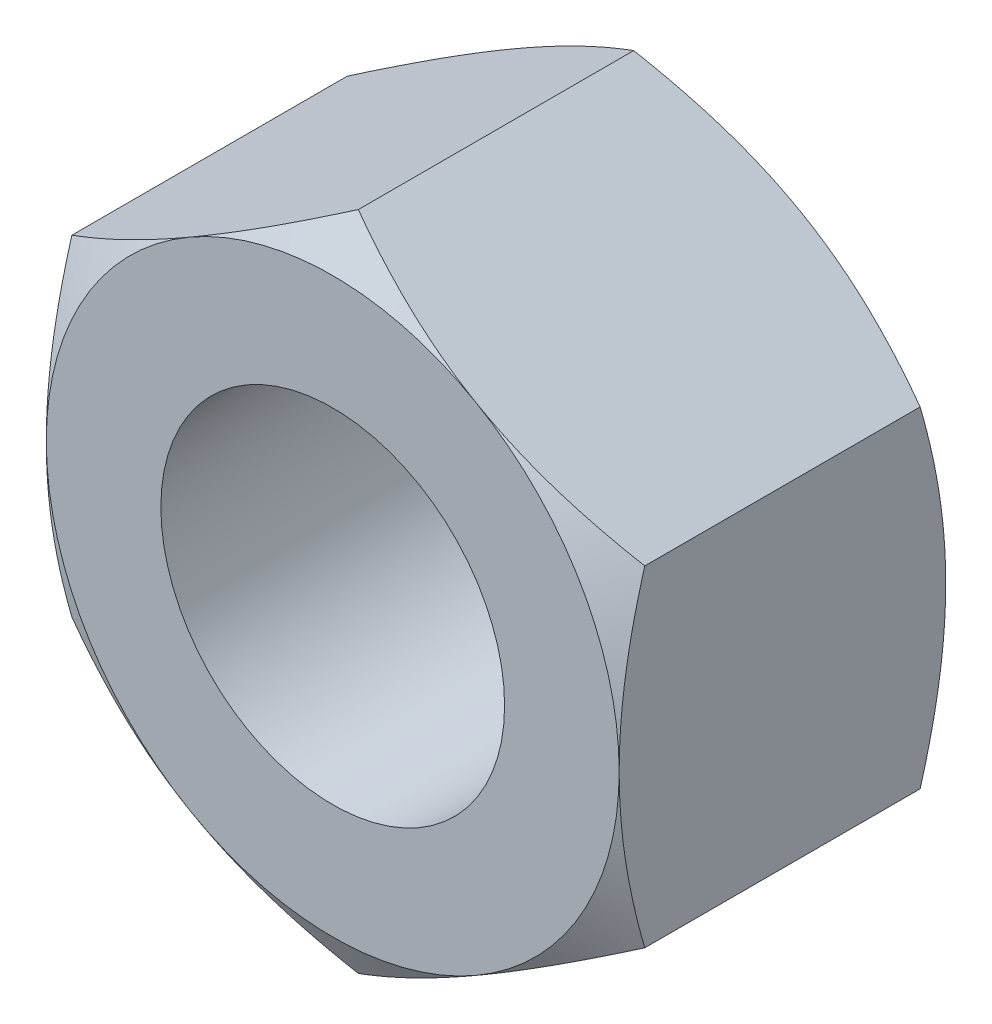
ISO-10303-21;
HEADER;
FILE_DESCRIPTION(('STEP AP214'),'2;1');
FILE_NAME('part.step','',(''),(''),'','','');
FILE_SCHEMA(('AUTOMOTIVE_DESIGN { 1 0 10303 214 1 1 1 1 }'));
ENDSEC;
DATA;
#1=APPLICATION_CONTEXT('core data for automotive mechanical design processes');
#2=APPLICATION_PROTOCOL_DEFINITION('international standard','automotive_design',2000,#1);
#3=PRODUCT_CONTEXT('',#1,'mechanical');
#4=PRODUCT('Part','Part','',(#3));
#5=PRODUCT_RELATED_PRODUCT_CATEGORY('part','',(#4));
#6=PRODUCT_DEFINITION_FORMATION('','',#4);
#7=PRODUCT_DEFINITION_CONTEXT('part definition',#1,'design');
#8=PRODUCT_DEFINITION('design','',#6,#7);
#9=PRODUCT_DEFINITION_SHAPE('','',#8);
#10=(LENGTH_UNIT() NAMED_UNIT(*) SI_UNIT(.MILLI.,.METRE.));
#11=(NAMED_UNIT(*) PLANE_ANGLE_UNIT() SI_UNIT($,.RADIAN.));
#12=(NAMED_UNIT(*) SI_UNIT($,.STERADIAN.) SOLID_ANGLE_UNIT());
#13=UNCERTAINTY_MEASURE_WITH_UNIT(LENGTH_MEASURE(1.E-05),#10,'distance_accuracy_value','');
#14=(GEOMETRIC_REPRESENTATION_CONTEXT(3) GLOBAL_UNCERTAINTY_ASSIGNED_CONTEXT((#13)) GLOBAL_UNIT_ASSIGNED_CONTEXT((#10,
#11,#12)) REPRESENTATION_CONTEXT('',''));
#15=CARTESIAN_POINT('',(0.,0.,0.));
#16=DIRECTION('',(0.,0.,1.));
#17=DIRECTION('',(1.,0.,0.));
#18=AXIS2_PLACEMENT_3D('',#15,#16,#17);
#19=CARTESIAN_POINT('',(-5.,8.66025403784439,0.));
#20=DIRECTION('',(0.,0.,-1.));
#21=DIRECTION('',(-1.,0.,0.));
#22=AXIS2_PLACEMENT_3D('',#19,#20,#21);
#23=PLANE('',#22);
#24=CARTESIAN_POINT('',(0.,0.,0.));
#25=DIRECTION('',(0.,0.,1.));
#26=DIRECTION('',(1.,0.,0.));
#27=AXIS2_PLACEMENT_3D('',#24,#25,#26);
#28=CIRCLE('',#27,3.);
#29=CARTESIAN_POINT('',(3.,0.,0.));
#30=VERTEX_POINT('',#29);
#31=EDGE_CURVE('E326',#30,#30,#28,.T.);
#32=ORIENTED_EDGE('',*,*,#31,.F.);
#33=EDGE_LOOP('',(#32));
#34=FACE_BOUND('',#33,.T.);
#35=CARTESIAN_POINT('',(0.,0.,0.));
#36=DIRECTION('',(0.,0.,-1.));
#37=DIRECTION('',(-1.,0.,0.));
#38=AXIS2_PLACEMENT_3D('',#35,#36,#37);
#39=CIRCLE('',#38,5.);
#40=CARTESIAN_POINT('',(-5.,0.,0.));
#41=VERTEX_POINT('',#40);
#42=CARTESIAN_POINT('',(-2.5,4.3301270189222,0.));
#43=VERTEX_POINT('',#42);
#44=EDGE_CURVE('E334',#41,#43,#39,.T.);
#45=ORIENTED_EDGE('',*,*,#44,.F.);
#46=CARTESIAN_POINT('',(0.,0.,0.));
#47=DIRECTION('',(0.,0.,-1.));
#48=DIRECTION('',(-1.,0.,0.));
#49=AXIS2_PLACEMENT_3D('',#46,#47,#48);
#50=CIRCLE('',#49,5.);
#51=CARTESIAN_POINT('',(-2.5,-4.3301270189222,0.));
#52=VERTEX_POINT('',#51);
#53=EDGE_CURVE('E156',#41,#52,#50,.F.);
#54=ORIENTED_EDGE('',*,*,#53,.T.);
#55=CARTESIAN_POINT('',(2.5,-4.3301270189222,0.));
#56=VERTEX_POINT('',#55);
#57=EDGE_CURVE('E258',#52,#56,#50,.F.);
#58=ORIENTED_EDGE('',*,*,#57,.T.);
#59=CARTESIAN_POINT('',(5.,0.,0.));
#60=VERTEX_POINT('',#59);
#61=EDGE_CURVE('E159',#56,#60,#50,.F.);
#62=ORIENTED_EDGE('',*,*,#61,.T.);
#63=CARTESIAN_POINT('',(2.5,4.3301270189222,0.));
#64=VERTEX_POINT('',#63);
#65=EDGE_CURVE('E134',#60,#64,#50,.F.);
#66=ORIENTED_EDGE('',*,*,#65,.T.);
#67=EDGE_CURVE('E147',#64,#43,#50,.F.);
#68=ORIENTED_EDGE('',*,*,#67,.T.);
#69=EDGE_LOOP('',(#45,#54,#58,#62,#66,#68));
#70=FACE_BOUND('',#69,.T.);
#71=ADVANCED_FACE('F39',(#34,#70),#23,.F.);
#72=CARTESIAN_POINT('',(0.,0.,0.));
#73=DIRECTION('',(0.,0.,-1.));
#74=DIRECTION('',(-1.,0.,0.));
#75=AXIS2_PLACEMENT_3D('',#72,#73,#74);
#76=CONICAL_SURFACE('',#75,5.,1.0471975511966);
#77=CARTESIAN_POINT('',(-5.,-7.79263325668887,-2.45881170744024));
#78=CARTESIAN_POINT('',(-5.,-7.57389437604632,-2.35254964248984));
#79=CARTESIAN_POINT('',(-5.,-7.3546574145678,-2.24729550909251));
#80=CARTESIAN_POINT('',(-5.,-6.91492254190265,-2.03936932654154));
#81=CARTESIAN_POINT('',(-5.,-6.69442444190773,-1.93669767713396));
#82=CARTESIAN_POINT('',(-5.,-6.25078515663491,-1.73399452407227));
#83=CARTESIAN_POINT('',(-5.,-6.02763614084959,-1.63398009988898));
#84=CARTESIAN_POINT('',(-5.,-5.57957631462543,-1.43799403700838));
#85=CARTESIAN_POINT('',(-5.,-5.35466558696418,-1.34202220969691));
#86=CARTESIAN_POINT('',(-5.,-4.89538145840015,-1.15215186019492));
#87=CARTESIAN_POINT('',(-5.,-4.66093798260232,-1.05842192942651));
#88=CARTESIAN_POINT('',(-5.,-4.18932259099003,-0.877963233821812));
#89=CARTESIAN_POINT('',(-5.,-3.95215037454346,-0.791235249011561));
#90=CARTESIAN_POINT('',(-5.,-3.4751315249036,-0.627028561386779));
#91=CARTESIAN_POINT('',(-5.,-3.23529128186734,-0.549531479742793));
#92=CARTESIAN_POINT('',(-5.,-2.75217077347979,-0.40624765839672));
#93=CARTESIAN_POINT('',(-5.,-2.50889160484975,-0.3404572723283));
#94=CARTESIAN_POINT('',(-5.,-2.02008055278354,-0.224062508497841));
#95=CARTESIAN_POINT('',(-5.,-1.77456851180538,-0.173376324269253));
#96=CARTESIAN_POINT('',(-5.,-1.28045177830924,-0.0900393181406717));
#97=CARTESIAN_POINT('',(-5.,-1.0318474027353,-0.057386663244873));
#98=CARTESIAN_POINT('',(-5.,-0.536052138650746,-0.0131473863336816));
#99=CARTESIAN_POINT('',(-5.,-0.288886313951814,-0.00128679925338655));
#100=CARTESIAN_POINT('',(-5.,0.205571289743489,0.00108642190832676));
#101=CARTESIAN_POINT('',(-5.,0.452863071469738,-0.00840142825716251));
#102=CARTESIAN_POINT('',(-5.,0.871498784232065,-0.0418591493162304));
#103=CARTESIAN_POINT('',(-5.,1.04328629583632,-0.0606070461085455));
#104=CARTESIAN_POINT('',(-5.,1.38562187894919,-0.107259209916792));
#105=CARTESIAN_POINT('',(-5.,1.55616978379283,-0.135164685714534));
#106=CARTESIAN_POINT('',(-5.,2.06571221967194,-0.231152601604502));
#107=CARTESIAN_POINT('',(-5.,2.40242483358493,-0.311490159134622));
#108=CARTESIAN_POINT('',(-5.,2.90606659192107,-0.451054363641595));
#109=CARTESIAN_POINT('',(-5.,3.07559782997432,-0.501427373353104));
#110=CARTESIAN_POINT('',(-5.,3.41301334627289,-0.607464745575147));
#111=CARTESIAN_POINT('',(-5.,3.58089761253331,-0.663129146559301));
#112=CARTESIAN_POINT('',(-5.,3.91507286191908,-0.778850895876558));
#113=CARTESIAN_POINT('',(-5.,4.08136432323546,-0.838906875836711));
#114=CARTESIAN_POINT('',(-5.,4.41256380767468,-0.962699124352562));
#115=CARTESIAN_POINT('',(-5.,4.57747185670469,-1.02643532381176));
#116=CARTESIAN_POINT('',(-5.,5.00346821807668,-1.19567231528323));
#117=CARTESIAN_POINT('',(-5.,5.26361814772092,-1.30353234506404));
#118=CARTESIAN_POINT('',(-5.,5.78140445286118,-1.525145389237));
#119=CARTESIAN_POINT('',(-5.,6.03904059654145,-1.63889894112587));
#120=CARTESIAN_POINT('',(-5.,6.55233519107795,-1.87096600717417));
#121=CARTESIAN_POINT('',(-5.,6.80799304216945,-1.98928084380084));
#122=CARTESIAN_POINT('',(-5.,7.31764782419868,-2.22944227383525));
#123=CARTESIAN_POINT('',(-5.,7.57164470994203,-2.35128896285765));
#124=CARTESIAN_POINT('',(-5.,8.0786286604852,-2.5979420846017));
#125=CARTESIAN_POINT('',(-5.,8.33161384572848,-2.72275237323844));
#126=CARTESIAN_POINT('',(-5.,8.83646440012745,-2.97461980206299));
#127=CARTESIAN_POINT('',(-5.,9.08832975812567,-3.10167696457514));
#128=CARTESIAN_POINT('',(-5.,9.84244997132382,-3.48551096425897));
#129=CARTESIAN_POINT('',(-5.,10.3433251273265,-3.74499752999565));
#130=CARTESIAN_POINT('',(-5.,11.2932969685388,-4.24307580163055));
#131=CARTESIAN_POINT('',(-5.,11.7426353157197,-4.48120875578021));
#132=CARTESIAN_POINT('',(-5.,12.6397634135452,-4.9604275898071));
#133=CARTESIAN_POINT('',(-5.,13.0875530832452,-5.20151362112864));
#134=CARTESIAN_POINT('',(-5.,13.9805858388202,-5.68515720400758));
#135=CARTESIAN_POINT('',(-5.,14.4258325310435,-5.9277081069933));
#136=CARTESIAN_POINT('',(-5.,15.3153548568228,-6.4145119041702));
#137=CARTESIAN_POINT('',(-5.,15.7596305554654,-6.6587646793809));
#138=CARTESIAN_POINT('',(-5.,16.2035600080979,-6.90364117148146));
#139=B_SPLINE_CURVE_WITH_KNOTS('',3,(#77,#78,#79,#80,#81,#82,#83,#84,#85,#86,#87,#88,#89,#90,
#91,#92,#93,#94,#95,#96,#97,#98,#99,#100,#101,#102,#103,#104,#105,#106,#107,#108,#109,#110,#111,
#112,#113,#114,#115,#116,#117,#118,#119,#120,#121,#122,#123,#124,#125,#126,#127,#128,#129,#130,
#131,#132,#133,#134,#135,#136,#137,#138),.UNSPECIFIED.,.F.,.F.,(4,2,2,2,2,2,2,2,2,2,2,2,2,2,2,2,
2,2,2,2,2,2,2,2,2,2,2,2,2,2,4),(0.,0.729559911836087,1.45923206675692,2.1928110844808,
2.92635583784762,3.6837265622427,4.44118154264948,5.19710227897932,5.95278714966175,
6.70430145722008,7.45573936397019,8.19719941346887,8.93867628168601,9.45684829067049,
9.97508872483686,11.0121112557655,11.5426353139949,12.0731632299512,12.6035265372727,
13.133879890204,13.9786448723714,14.8234870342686,15.6685760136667,16.5136878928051,
17.3599671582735,18.2062548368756,19.898508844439,21.4241154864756,22.9498006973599,
24.4708753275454,25.99184466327),.UNSPECIFIED.);
#140=CARTESIAN_POINT('',(-5.,2.88675134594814,-0.446581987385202));
#141=VERTEX_POINT('',#140);
#142=EDGE_CURVE('E164',#141,#41,#139,.F.);
#143=ORIENTED_EDGE('',*,*,#142,.T.);
#144=ORIENTED_EDGE('',*,*,#44,.T.);
#145=CARTESIAN_POINT('',(0.0002,5.7736181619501,-0.446648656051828));
#146=CARTESIAN_POINT('',(-0.219534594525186,5.64675433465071,-0.373386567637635));
#147=CARTESIAN_POINT('',(-0.441148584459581,5.5188054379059,-0.306751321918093));
#148=CARTESIAN_POINT('',(-0.888213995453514,5.26069210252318,-0.190438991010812));
#149=CARTESIAN_POINT('',(-1.11367335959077,5.13052307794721,-0.140803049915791));
#150=CARTESIAN_POINT('',(-1.56183230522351,4.87177839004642,-0.0635510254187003));
#151=CARTESIAN_POINT('',(-1.78446209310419,4.74324302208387,-0.0354203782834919));
#152=CARTESIAN_POINT('',(-2.11918990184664,4.54998783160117,-0.0101949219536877));
#153=CARTESIAN_POINT('',(-2.23084219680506,4.48552534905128,-0.00461345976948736));
#154=CARTESIAN_POINT('',(-2.4542499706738,4.35654081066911,0.000797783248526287));
#155=CARTESIAN_POINT('',(-2.56600544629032,4.29201875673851,0.000627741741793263));
#156=CARTESIAN_POINT('',(-2.87218423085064,4.11524635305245,-0.00775363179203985));
#157=CARTESIAN_POINT('',(-3.06650608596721,4.00305457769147,-0.0218297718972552));
#158=CARTESIAN_POINT('',(-3.45386010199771,3.77941563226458,-0.0664652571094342));
#159=CARTESIAN_POINT('',(-3.64689090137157,3.66796924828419,-0.0970398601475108));
#160=CARTESIAN_POINT('',(-4.03502534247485,3.44387972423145,-0.173468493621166));
#161=CARTESIAN_POINT('',(-4.23007999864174,3.33126486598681,-0.219646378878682));
#162=CARTESIAN_POINT('',(-4.61728034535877,3.10771464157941,-0.324451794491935));
#163=CARTESIAN_POINT('',(-4.80943099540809,2.99677641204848,-0.383054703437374));
#164=CARTESIAN_POINT('',(-5.0002,2.8866358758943,-0.446648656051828));
#165=B_SPLINE_CURVE_WITH_KNOTS('',3,(#145,#146,#147,#148,#149,#150,#151,#152,#153,#154,#155,
#156,#157,#158,#159,#160,#161,#162,#163,#164),.UNSPECIFIED.,.F.,.F.,(4,2,2,2,2,2,2,2,2,4),(0.,
0.792555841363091,1.58701660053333,2.3618153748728,2.74884076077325,3.13585419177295,
3.80962362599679,4.48401723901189,5.17336882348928,5.86136694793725),.UNSPECIFIED.);
#166=EDGE_CURVE('E196',#43,#141,#165,.T.);
#167=ORIENTED_EDGE('',*,*,#166,.T.);
#168=EDGE_LOOP('',(#143,#144,#167));
#169=FACE_BOUND('',#168,.T.);
#170=ADVANCED_FACE('F183',(#169),#76,.T.);
#171=CARTESIAN_POINT('',(5.0002,2.8866358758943,-0.446648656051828));
#172=CARTESIAN_POINT('',(4.78046540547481,3.01349970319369,-0.373386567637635));
#173=CARTESIAN_POINT('',(4.55885141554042,3.1414485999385,-0.306751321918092));
#174=CARTESIAN_POINT('',(4.11178600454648,3.39956193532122,-0.190438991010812));
#175=CARTESIAN_POINT('',(3.88632664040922,3.52973095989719,-0.140803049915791));
#176=CARTESIAN_POINT('',(3.43816769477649,3.78847564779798,-0.0635510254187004));
#177=CARTESIAN_POINT('',(3.21553790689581,3.91701101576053,-0.0354203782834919));
#178=CARTESIAN_POINT('',(2.88081009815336,4.11026620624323,-0.0101949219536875));
#179=CARTESIAN_POINT('',(2.76915780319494,4.17472868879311,-0.0046134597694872));
#180=CARTESIAN_POINT('',(2.5457500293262,4.30371322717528,0.000797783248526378));
#181=CARTESIAN_POINT('',(2.43399455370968,4.3682352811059,0.000627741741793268));
#182=CARTESIAN_POINT('',(2.12781576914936,4.54500768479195,-0.00775363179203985));
#183=CARTESIAN_POINT('',(1.93349391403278,4.65719946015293,-0.0218297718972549));
#184=CARTESIAN_POINT('',(1.54613989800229,4.88083840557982,-0.066465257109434));
#185=CARTESIAN_POINT('',(1.35310909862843,4.99228478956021,-0.0970398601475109));
#186=CARTESIAN_POINT('',(0.964974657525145,5.21637431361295,-0.173468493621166));
#187=CARTESIAN_POINT('',(0.769920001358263,5.32898917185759,-0.219646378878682));
#188=CARTESIAN_POINT('',(0.382719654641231,5.55253939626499,-0.324451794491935));
#189=CARTESIAN_POINT('',(0.190569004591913,5.66347762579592,-0.383054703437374));
#190=CARTESIAN_POINT('',(-0.000200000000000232,5.7736181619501,-0.446648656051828));
#191=B_SPLINE_CURVE_WITH_KNOTS('',3,(#171,#172,#173,#174,#175,#176,#177,#178,#179,#180,#181,
#182,#183,#184,#185,#186,#187,#188,#189,#190),.UNSPECIFIED.,.F.,.F.,(4,2,2,2,2,2,2,2,2,4),(0.,
0.792555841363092,1.58701660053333,2.36181537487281,2.74884076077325,3.13585419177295,
3.80962362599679,4.48401723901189,5.17336882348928,5.86136694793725),.UNSPECIFIED.);
#192=CARTESIAN_POINT('',(0.,5.77350269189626,-0.446581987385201));
#193=VERTEX_POINT('',#192);
#194=EDGE_CURVE('E143',#64,#193,#191,.T.);
#195=ORIENTED_EDGE('',*,*,#194,.T.);
#196=EDGE_CURVE('E150',#193,#43,#165,.T.);
#197=ORIENTED_EDGE('',*,*,#196,.T.);
#198=ORIENTED_EDGE('',*,*,#67,.F.);
#199=EDGE_LOOP('',(#195,#197,#198));
#200=FACE_BOUND('',#199,.T.);
#201=ADVANCED_FACE('F148',(#200),#76,.T.);
#202=CARTESIAN_POINT('',(5.,-7.79263325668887,-2.45881170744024));
#203=CARTESIAN_POINT('',(5.,-7.57389437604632,-2.35254964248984));
#204=CARTESIAN_POINT('',(5.,-7.3546574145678,-2.24729550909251));
#205=CARTESIAN_POINT('',(5.,-6.91492254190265,-2.03936932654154));
#206=CARTESIAN_POINT('',(5.,-6.69442444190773,-1.93669767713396));
#207=CARTESIAN_POINT('',(5.,-6.25078515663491,-1.73399452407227));
#208=CARTESIAN_POINT('',(5.,-6.02763614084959,-1.63398009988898));
#209=CARTESIAN_POINT('',(5.,-5.57957631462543,-1.43799403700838));
#210=CARTESIAN_POINT('',(5.,-5.35466558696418,-1.34202220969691));
#211=CARTESIAN_POINT('',(5.,-4.89538145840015,-1.15215186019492));
#212=CARTESIAN_POINT('',(5.,-4.66093798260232,-1.05842192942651));
#213=CARTESIAN_POINT('',(5.,-4.18932259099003,-0.877963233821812));
#214=CARTESIAN_POINT('',(5.,-3.95215037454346,-0.791235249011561));
#215=CARTESIAN_POINT('',(5.,-3.4751315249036,-0.627028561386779));
#216=CARTESIAN_POINT('',(5.,-3.23529128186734,-0.549531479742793));
#217=CARTESIAN_POINT('',(5.,-2.75217077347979,-0.40624765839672));
#218=CARTESIAN_POINT('',(5.,-2.50889160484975,-0.3404572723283));
#219=CARTESIAN_POINT('',(5.,-2.02008055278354,-0.224062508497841));
#220=CARTESIAN_POINT('',(5.,-1.77456851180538,-0.173376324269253));
#221=CARTESIAN_POINT('',(5.,-1.28045177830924,-0.0900393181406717));
#222=CARTESIAN_POINT('',(5.,-1.0318474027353,-0.057386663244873));
#223=CARTESIAN_POINT('',(5.,-0.536052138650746,-0.0131473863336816));
#224=CARTESIAN_POINT('',(5.,-0.288886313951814,-0.00128679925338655));
#225=CARTESIAN_POINT('',(5.,0.205571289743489,0.00108642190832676));
#226=CARTESIAN_POINT('',(5.,0.452863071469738,-0.00840142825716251));
#227=CARTESIAN_POINT('',(5.,0.871498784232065,-0.0418591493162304));
#228=CARTESIAN_POINT('',(5.,1.04328629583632,-0.0606070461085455));
#229=CARTESIAN_POINT('',(5.,1.38562187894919,-0.107259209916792));
#230=CARTESIAN_POINT('',(5.,1.55616978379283,-0.135164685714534));
#231=CARTESIAN_POINT('',(5.,2.06571221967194,-0.231152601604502));
#232=CARTESIAN_POINT('',(5.,2.40242483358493,-0.311490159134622));
#233=CARTESIAN_POINT('',(5.,2.90606659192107,-0.451054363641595));
#234=CARTESIAN_POINT('',(5.,3.07559782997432,-0.501427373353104));
#235=CARTESIAN_POINT('',(5.,3.41301334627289,-0.607464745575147));
#236=CARTESIAN_POINT('',(5.,3.58089761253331,-0.663129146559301));
#237=CARTESIAN_POINT('',(5.,3.91507286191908,-0.778850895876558));
#238=CARTESIAN_POINT('',(5.,4.08136432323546,-0.838906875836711));
#239=CARTESIAN_POINT('',(5.,4.41256380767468,-0.962699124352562));
#240=CARTESIAN_POINT('',(5.,4.57747185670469,-1.02643532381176));
#241=CARTESIAN_POINT('',(5.,5.00346821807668,-1.19567231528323));
#242=CARTESIAN_POINT('',(5.,5.26361814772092,-1.30353234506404));
#243=CARTESIAN_POINT('',(5.,5.78140445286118,-1.525145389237));
#244=CARTESIAN_POINT('',(5.,6.03904059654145,-1.63889894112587));
#245=CARTESIAN_POINT('',(5.,6.55233519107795,-1.87096600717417));
#246=CARTESIAN_POINT('',(5.,6.80799304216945,-1.98928084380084));
#247=CARTESIAN_POINT('',(5.,7.31764782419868,-2.22944227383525));
#248=CARTESIAN_POINT('',(5.,7.57164470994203,-2.35128896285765));
#249=CARTESIAN_POINT('',(5.,8.0786286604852,-2.5979420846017));
#250=CARTESIAN_POINT('',(5.,8.33161384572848,-2.72275237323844));
#251=CARTESIAN_POINT('',(5.,8.83646440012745,-2.97461980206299));
#252=CARTESIAN_POINT('',(5.,9.08832975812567,-3.10167696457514));
#253=CARTESIAN_POINT('',(5.,9.84244997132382,-3.48551096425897));
#254=CARTESIAN_POINT('',(5.,10.3433251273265,-3.74499752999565));
#255=CARTESIAN_POINT('',(5.,11.2932969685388,-4.24307580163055));
#256=CARTESIAN_POINT('',(5.,11.7426353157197,-4.48120875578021));
#257=CARTESIAN_POINT('',(5.,12.6397634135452,-4.9604275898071));
#258=CARTESIAN_POINT('',(5.,13.0875530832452,-5.20151362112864));
#259=CARTESIAN_POINT('',(5.,13.9805858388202,-5.68515720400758));
#260=CARTESIAN_POINT('',(5.,14.4258325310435,-5.9277081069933));
#261=CARTESIAN_POINT('',(5.,15.3153548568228,-6.4145119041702));
#262=CARTESIAN_POINT('',(5.,15.7596305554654,-6.6587646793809));
#263=CARTESIAN_POINT('',(5.,16.2035600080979,-6.90364117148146));
#264=B_SPLINE_CURVE_WITH_KNOTS('',3,(#202,#203,#204,#205,#206,#207,#208,#209,#210,#211,#212,
#213,#214,#215,#216,#217,#218,#219,#220,#221,#222,#223,#224,#225,#226,#227,#228,#229,#230,#231,
#232,#233,#234,#235,#236,#237,#238,#239,#240,#241,#242,#243,#244,#245,#246,#247,#248,#249,#250,
#251,#252,#253,#254,#255,#256,#257,#258,#259,#260,#261,#262,#263),.UNSPECIFIED.,.F.,.F.,(4,2,2,
2,2,2,2,2,2,2,2,2,2,2,2,2,2,2,2,2,2,2,2,2,2,2,2,2,2,2,4),(0.,0.729559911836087,1.45923206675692,
2.1928110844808,2.92635583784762,3.6837265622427,4.44118154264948,5.19710227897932,
5.95278714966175,6.70430145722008,7.45573936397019,8.19719941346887,8.93867628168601,
9.45684829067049,9.97508872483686,11.0121112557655,11.5426353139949,12.0731632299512,
12.6035265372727,13.133879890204,13.9786448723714,14.8234870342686,15.6685760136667,
16.5136878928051,17.3599671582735,18.2062548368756,19.898508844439,21.4241154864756,
22.9498006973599,24.4708753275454,25.99184466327),.UNSPECIFIED.);
#265=CARTESIAN_POINT('',(5.,2.88675134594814,-0.446581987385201));
#266=VERTEX_POINT('',#265);
#267=EDGE_CURVE('E137',#60,#266,#264,.T.);
#268=ORIENTED_EDGE('',*,*,#267,.T.);
#269=EDGE_CURVE('E130',#266,#64,#191,.T.);
#270=ORIENTED_EDGE('',*,*,#269,.T.);
#271=ORIENTED_EDGE('',*,*,#65,.F.);
#272=EDGE_LOOP('',(#268,#270,#271));
#273=FACE_BOUND('',#272,.T.);
#274=ADVANCED_FACE('F132',(#273),#76,.T.);
#275=CARTESIAN_POINT('',(-0.0002,-5.7736181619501,-0.446648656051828));
#276=CARTESIAN_POINT('',(0.219534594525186,-5.64675433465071,-0.373386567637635));
#277=CARTESIAN_POINT('',(0.441148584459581,-5.5188054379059,-0.306751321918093));
#278=CARTESIAN_POINT('',(0.888213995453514,-5.26069210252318,-0.190438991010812));
#279=CARTESIAN_POINT('',(1.11367335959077,-5.13052307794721,-0.140803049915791));
#280=CARTESIAN_POINT('',(1.56183230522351,-4.87177839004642,-0.0635510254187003));
#281=CARTESIAN_POINT('',(1.78446209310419,-4.74324302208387,-0.0354203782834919));
#282=CARTESIAN_POINT('',(2.11918990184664,-4.54998783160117,-0.0101949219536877));
#283=CARTESIAN_POINT('',(2.23084219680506,-4.48552534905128,-0.00461345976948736));
#284=CARTESIAN_POINT('',(2.4542499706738,-4.35654081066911,0.000797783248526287));
#285=CARTESIAN_POINT('',(2.56600544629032,-4.29201875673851,0.000627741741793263));
#286=CARTESIAN_POINT('',(2.87218423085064,-4.11524635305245,-0.00775363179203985));
#287=CARTESIAN_POINT('',(3.06650608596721,-4.00305457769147,-0.0218297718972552));
#288=CARTESIAN_POINT('',(3.45386010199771,-3.77941563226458,-0.0664652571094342));
#289=CARTESIAN_POINT('',(3.64689090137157,-3.66796924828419,-0.0970398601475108));
#290=CARTESIAN_POINT('',(4.03502534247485,-3.44387972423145,-0.173468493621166));
#291=CARTESIAN_POINT('',(4.23007999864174,-3.33126486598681,-0.219646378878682));
#292=CARTESIAN_POINT('',(4.61728034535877,-3.10771464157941,-0.324451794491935));
#293=CARTESIAN_POINT('',(4.80943099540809,-2.99677641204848,-0.383054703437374));
#294=CARTESIAN_POINT('',(5.0002,-2.8866358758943,-0.446648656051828));
#295=B_SPLINE_CURVE_WITH_KNOTS('',3,(#275,#276,#277,#278,#279,#280,#281,#282,#283,#284,#285,
#286,#287,#288,#289,#290,#291,#292,#293,#294),.UNSPECIFIED.,.F.,.F.,(4,2,2,2,2,2,2,2,2,4),(0.,
0.792555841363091,1.58701660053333,2.3618153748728,2.74884076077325,3.13585419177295,
3.80962362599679,4.48401723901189,5.17336882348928,5.86136694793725),.UNSPECIFIED.);
#296=CARTESIAN_POINT('',(5.,-2.88675134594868,-0.44658198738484));
#297=VERTEX_POINT('',#296);
#298=EDGE_CURVE('E210',#56,#297,#295,.T.);
#299=ORIENTED_EDGE('',*,*,#298,.T.);
#300=EDGE_CURVE('E209',#297,#60,#264,.T.);
#301=ORIENTED_EDGE('',*,*,#300,.T.);
#302=ORIENTED_EDGE('',*,*,#61,.F.);
#303=EDGE_LOOP('',(#299,#301,#302));
#304=FACE_BOUND('',#303,.T.);
#305=ADVANCED_FACE('F441',(#304),#76,.T.);
#306=CARTESIAN_POINT('',(0.,-5.77350269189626,-0.446581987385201));
#307=VERTEX_POINT('',#306);
#308=EDGE_CURVE('E268',#307,#56,#295,.T.);
#309=ORIENTED_EDGE('',*,*,#308,.T.);
#310=ORIENTED_EDGE('',*,*,#57,.F.);
#311=CARTESIAN_POINT('',(-5.0002,-2.8866358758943,-0.446648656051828));
#312=CARTESIAN_POINT('',(-4.78046540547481,-3.01349970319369,-0.373386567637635));
#313=CARTESIAN_POINT('',(-4.55885141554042,-3.1414485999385,-0.306751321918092));
#314=CARTESIAN_POINT('',(-4.11178600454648,-3.39956193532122,-0.190438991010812));
#315=CARTESIAN_POINT('',(-3.88632664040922,-3.52973095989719,-0.140803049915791));
#316=CARTESIAN_POINT('',(-3.43816769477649,-3.78847564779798,-0.0635510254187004));
#317=CARTESIAN_POINT('',(-3.21553790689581,-3.91701101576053,-0.0354203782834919));
#318=CARTESIAN_POINT('',(-2.88081009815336,-4.11026620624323,-0.0101949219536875));
#319=CARTESIAN_POINT('',(-2.76915780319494,-4.17472868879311,-0.0046134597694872));
#320=CARTESIAN_POINT('',(-2.5457500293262,-4.30371322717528,0.000797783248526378));
#321=CARTESIAN_POINT('',(-2.43399455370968,-4.3682352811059,0.000627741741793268));
#322=CARTESIAN_POINT('',(-2.12781576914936,-4.54500768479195,-0.00775363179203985));
#323=CARTESIAN_POINT('',(-1.93349391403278,-4.65719946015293,-0.0218297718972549));
#324=CARTESIAN_POINT('',(-1.54613989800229,-4.88083840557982,-0.066465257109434));
#325=CARTESIAN_POINT('',(-1.35310909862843,-4.99228478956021,-0.0970398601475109));
#326=CARTESIAN_POINT('',(-0.964974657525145,-5.21637431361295,-0.173468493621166));
#327=CARTESIAN_POINT('',(-0.769920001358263,-5.32898917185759,-0.219646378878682));
#328=CARTESIAN_POINT('',(-0.382719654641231,-5.55253939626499,-0.324451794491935));
#329=CARTESIAN_POINT('',(-0.190569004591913,-5.66347762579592,-0.383054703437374));
#330=CARTESIAN_POINT('',(0.000200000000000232,-5.7736181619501,-0.446648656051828));
#331=B_SPLINE_CURVE_WITH_KNOTS('',3,(#311,#312,#313,#314,#315,#316,#317,#318,#319,#320,#321,
#322,#323,#324,#325,#326,#327,#328,#329,#330),.UNSPECIFIED.,.F.,.F.,(4,2,2,2,2,2,2,2,2,4),(0.,
0.792555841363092,1.58701660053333,2.36181537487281,2.74884076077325,3.13585419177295,
3.80962362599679,4.48401723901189,5.17336882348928,5.86136694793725),.UNSPECIFIED.);
#332=EDGE_CURVE('E272',#52,#307,#331,.T.);
#333=ORIENTED_EDGE('',*,*,#332,.T.);
#334=EDGE_LOOP('',(#309,#310,#333));
#335=FACE_BOUND('',#334,.T.);
#336=ADVANCED_FACE('F189',(#335),#76,.T.);
#337=CARTESIAN_POINT('',(-5.,-2.88675134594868,-0.44658198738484));
#338=VERTEX_POINT('',#337);
#339=EDGE_CURVE('E177',#338,#52,#331,.T.);
#340=ORIENTED_EDGE('',*,*,#339,.T.);
#341=ORIENTED_EDGE('',*,*,#53,.F.);
#342=EDGE_CURVE('E142',#41,#338,#139,.F.);
#343=ORIENTED_EDGE('',*,*,#342,.T.);
#344=EDGE_LOOP('',(#340,#341,#343));
#345=FACE_BOUND('',#344,.T.);
#346=ADVANCED_FACE('F277',(#345),#76,.T.);
#347=CARTESIAN_POINT('',(5.,2.88675134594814,-5.7));
#348=DIRECTION('',(0.499999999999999,0.866025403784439,0.));
#349=DIRECTION('',(-0.866025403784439,0.499999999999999,0.));
#350=AXIS2_PLACEMENT_3D('',#347,#348,#349);
#351=PLANE('',#350);
#352=CARTESIAN_POINT('',(-0.0002,5.7736181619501,-5.25335134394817));
#353=CARTESIAN_POINT('',(0.219534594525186,5.64675433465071,-5.32661343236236));
#354=CARTESIAN_POINT('',(0.441148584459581,5.5188054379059,-5.39324867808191));
#355=CARTESIAN_POINT('',(0.888213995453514,5.26069210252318,-5.50956100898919));
#356=CARTESIAN_POINT('',(1.11367335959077,5.13052307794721,-5.55919695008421));
#357=CARTESIAN_POINT('',(1.56183230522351,4.87177839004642,-5.6364489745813));
#358=CARTESIAN_POINT('',(1.78446209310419,4.74324302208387,-5.66457962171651));
#359=CARTESIAN_POINT('',(2.11918990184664,4.54998783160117,-5.68980507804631));
#360=CARTESIAN_POINT('',(2.23084219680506,4.48552534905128,-5.69538654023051));
#361=CARTESIAN_POINT('',(2.4542499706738,4.35654081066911,-5.70079778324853));
#362=CARTESIAN_POINT('',(2.56600544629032,4.29201875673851,-5.70062774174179));
#363=CARTESIAN_POINT('',(2.87218423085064,4.11524635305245,-5.69224636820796));
#364=CARTESIAN_POINT('',(3.06650608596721,4.00305457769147,-5.67817022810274));
#365=CARTESIAN_POINT('',(3.45386010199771,3.77941563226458,-5.63353474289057));
#366=CARTESIAN_POINT('',(3.64689090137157,3.66796924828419,-5.60296013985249));
#367=CARTESIAN_POINT('',(4.03502534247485,3.44387972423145,-5.52653150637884));
#368=CARTESIAN_POINT('',(4.23007999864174,3.33126486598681,-5.48035362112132));
#369=CARTESIAN_POINT('',(4.61728034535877,3.10771464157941,-5.37554820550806));
#370=CARTESIAN_POINT('',(4.80943099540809,2.99677641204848,-5.31694529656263));
#371=CARTESIAN_POINT('',(5.0002,2.8866358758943,-5.25335134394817));
#372=B_SPLINE_CURVE_WITH_KNOTS('',3,(#352,#353,#354,#355,#356,#357,#358,#359,#360,#361,#362,
#363,#364,#365,#366,#367,#368,#369,#370,#371),.UNSPECIFIED.,.F.,.F.,(4,2,2,2,2,2,2,2,2,4),(0.,
0.792555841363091,1.58701660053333,2.3618153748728,2.74884076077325,3.13585419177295,
3.80962362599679,4.48401723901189,5.17336882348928,5.86136694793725),.UNSPECIFIED.);
#373=CARTESIAN_POINT('',(0.,5.77350269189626,-5.2534180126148));
#374=VERTEX_POINT('',#373);
#375=CARTESIAN_POINT('',(2.5,4.3301270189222,-5.7));
#376=VERTEX_POINT('',#375);
#377=EDGE_CURVE('E243',#374,#376,#372,.T.);
#378=ORIENTED_EDGE('',*,*,#377,.F.);
#379=DIRECTION('',(0.,0.,1.));
#380=VECTOR('',#379,1.);
#381=CARTESIAN_POINT('',(0.,5.77350269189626,-5.7));
#382=LINE('',#381,#380);
#383=EDGE_CURVE('E163',#374,#193,#382,.T.);
#384=ORIENTED_EDGE('',*,*,#383,.T.);
#385=ORIENTED_EDGE('',*,*,#194,.F.);
#386=ORIENTED_EDGE('',*,*,#269,.F.);
#387=DIRECTION('',(0.,0.,1.));
#388=VECTOR('',#387,1.);
#389=CARTESIAN_POINT('',(5.,2.88675134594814,-5.7));
#390=LINE('',#389,#388);
#391=CARTESIAN_POINT('',(5.,2.88675134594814,-5.2534180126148));
#392=VERTEX_POINT('',#391);
#393=EDGE_CURVE('E155',#392,#266,#390,.T.);
#394=ORIENTED_EDGE('',*,*,#393,.F.);
#395=EDGE_CURVE('E238',#376,#392,#372,.T.);
#396=ORIENTED_EDGE('',*,*,#395,.F.);
#397=EDGE_LOOP('',(#378,#384,#385,#386,#394,#396));
#398=FACE_BOUND('',#397,.T.);
#399=ADVANCED_FACE('F41',(#398),#351,.T.);
#400=CARTESIAN_POINT('',(5.,-2.88675134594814,-5.7));
#401=DIRECTION('',(1.,0.,0.));
#402=DIRECTION('',(0.,0.,-1.));
#403=AXIS2_PLACEMENT_3D('',#400,#401,#402);
#404=PLANE('',#403);
#405=CARTESIAN_POINT('',(5.,-7.79263325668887,-3.24118829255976));
#406=CARTESIAN_POINT('',(5.,-7.57389437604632,-3.34745035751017));
#407=CARTESIAN_POINT('',(5.,-7.3546574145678,-3.45270449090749));
#408=CARTESIAN_POINT('',(5.,-6.91492254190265,-3.66063067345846));
#409=CARTESIAN_POINT('',(5.,-6.69442444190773,-3.76330232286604));
#410=CARTESIAN_POINT('',(5.,-6.25078515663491,-3.96600547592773));
#411=CARTESIAN_POINT('',(5.,-6.02763614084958,-4.06601990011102));
#412=CARTESIAN_POINT('',(5.,-5.57957631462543,-4.26200596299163));
#413=CARTESIAN_POINT('',(5.,-5.35466558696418,-4.35797779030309));
#414=CARTESIAN_POINT('',(5.,-4.89538145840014,-4.54784813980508));
#415=CARTESIAN_POINT('',(5.,-4.66093798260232,-4.64157807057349));
#416=CARTESIAN_POINT('',(5.,-4.18932259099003,-4.82203676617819));
#417=CARTESIAN_POINT('',(5.,-3.95215037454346,-4.90876475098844));
#418=CARTESIAN_POINT('',(5.,-3.4751315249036,-5.07297143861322));
#419=CARTESIAN_POINT('',(5.,-3.23529128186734,-5.15046852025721));
#420=CARTESIAN_POINT('',(5.,-2.75217077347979,-5.29375234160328));
#421=CARTESIAN_POINT('',(5.,-2.50889160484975,-5.3595427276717));
#422=CARTESIAN_POINT('',(5.,-2.02008055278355,-5.47593749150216));
#423=CARTESIAN_POINT('',(5.,-1.77456851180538,-5.52662367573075));
#424=CARTESIAN_POINT('',(5.,-1.28045177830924,-5.60996068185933));
#425=CARTESIAN_POINT('',(5.,-1.0318474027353,-5.64261333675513));
#426=CARTESIAN_POINT('',(5.,-0.536052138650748,-5.68685261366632));
#427=CARTESIAN_POINT('',(5.,-0.288886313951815,-5.69871320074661));
#428=CARTESIAN_POINT('',(5.,0.205571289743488,-5.70108642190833));
#429=CARTESIAN_POINT('',(5.,0.452863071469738,-5.69159857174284));
#430=CARTESIAN_POINT('',(5.,0.871498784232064,-5.65814085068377));
#431=CARTESIAN_POINT('',(5.,1.04328629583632,-5.63939295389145));
#432=CARTESIAN_POINT('',(5.,1.38562187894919,-5.59274079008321));
#433=CARTESIAN_POINT('',(5.,1.55616978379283,-5.56483531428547));
#434=CARTESIAN_POINT('',(5.,2.06571221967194,-5.4688473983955));
#435=CARTESIAN_POINT('',(5.,2.40242483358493,-5.38850984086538));
#436=CARTESIAN_POINT('',(5.,2.90606659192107,-5.24894563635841));
#437=CARTESIAN_POINT('',(5.,3.07559782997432,-5.19857262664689));
#438=CARTESIAN_POINT('',(5.,3.41301334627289,-5.09253525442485));
#439=CARTESIAN_POINT('',(5.,3.58089761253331,-5.0368708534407));
#440=CARTESIAN_POINT('',(5.,3.91507286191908,-4.92114910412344));
#441=CARTESIAN_POINT('',(5.,4.08136432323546,-4.86109312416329));
#442=CARTESIAN_POINT('',(5.,4.41256380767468,-4.73730087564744));
#443=CARTESIAN_POINT('',(5.,4.57747185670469,-4.67356467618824));
#444=CARTESIAN_POINT('',(5.,5.00346821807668,-4.50432768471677));
#445=CARTESIAN_POINT('',(5.,5.26361814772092,-4.39646765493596));
#446=CARTESIAN_POINT('',(5.,5.78140445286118,-4.174854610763));
#447=CARTESIAN_POINT('',(5.,6.03904059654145,-4.06110105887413));
#448=CARTESIAN_POINT('',(5.,6.55233519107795,-3.82903399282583));
#449=CARTESIAN_POINT('',(5.,6.80799304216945,-3.71071915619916));
#450=CARTESIAN_POINT('',(5.,7.31764782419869,-3.47055772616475));
#451=CARTESIAN_POINT('',(5.,7.57164470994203,-3.34871103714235));
#452=CARTESIAN_POINT('',(5.,8.0786286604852,-3.1020579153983));
#453=CARTESIAN_POINT('',(5.,8.33161384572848,-2.97724762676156));
#454=CARTESIAN_POINT('',(5.,8.83646440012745,-2.72538019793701));
#455=CARTESIAN_POINT('',(5.,9.08832975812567,-2.59832303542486));
#456=CARTESIAN_POINT('',(5.,9.84244997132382,-2.21448903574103));
#457=CARTESIAN_POINT('',(5.,10.3433251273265,-1.95500247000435));
#458=CARTESIAN_POINT('',(5.,11.2932969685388,-1.45692419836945));
#459=CARTESIAN_POINT('',(5.,11.7426353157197,-1.2187912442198));
#460=CARTESIAN_POINT('',(5.,12.6397634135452,-0.739572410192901));
#461=CARTESIAN_POINT('',(5.,13.0875530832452,-0.498486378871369));
#462=CARTESIAN_POINT('',(5.,13.9805858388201,-0.0148427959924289));
#463=CARTESIAN_POINT('',(5.,14.4258325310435,0.227708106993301));
#464=CARTESIAN_POINT('',(5.,15.3153548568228,0.714511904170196));
#465=CARTESIAN_POINT('',(5.,15.7596305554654,0.958764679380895));
#466=CARTESIAN_POINT('',(5.,16.2035600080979,1.20364117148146));
#467=B_SPLINE_CURVE_WITH_KNOTS('',3,(#405,#406,#407,#408,#409,#410,#411,#412,#413,#414,#415,
#416,#417,#418,#419,#420,#421,#422,#423,#424,#425,#426,#427,#428,#429,#430,#431,#432,#433,#434,
#435,#436,#437,#438,#439,#440,#441,#442,#443,#444,#445,#446,#447,#448,#449,#450,#451,#452,#453,
#454,#455,#456,#457,#458,#459,#460,#461,#462,#463,#464,#465,#466),.UNSPECIFIED.,.F.,.F.,(4,2,2,
2,2,2,2,2,2,2,2,2,2,2,2,2,2,2,2,2,2,2,2,2,2,2,2,2,2,2,4),(0.,0.729559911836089,1.45923206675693,
2.1928110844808,2.92635583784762,3.6837265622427,4.44118154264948,5.19710227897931,
5.95278714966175,6.70430145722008,7.45573936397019,8.19719941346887,8.93867628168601,
9.45684829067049,9.97508872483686,11.0121112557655,11.5426353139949,12.0731632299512,
12.6035265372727,13.133879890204,13.9786448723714,14.8234870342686,15.6685760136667,
16.5136878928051,17.3599671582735,18.2062548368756,19.898508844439,21.4241154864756,
22.9498006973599,24.4708753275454,25.9918446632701),.UNSPECIFIED.);
#468=CARTESIAN_POINT('',(5.,0.,-5.7));
#469=VERTEX_POINT('',#468);
#470=EDGE_CURVE('E232',#392,#469,#467,.F.);
#471=ORIENTED_EDGE('',*,*,#470,.F.);
#472=ORIENTED_EDGE('',*,*,#393,.T.);
#473=ORIENTED_EDGE('',*,*,#267,.F.);
#474=ORIENTED_EDGE('',*,*,#300,.F.);
#475=DIRECTION('',(0.,0.,1.));
#476=VECTOR('',#475,1.);
#477=CARTESIAN_POINT('',(5.,-2.88675134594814,-5.7));
#478=LINE('',#477,#476);
#479=CARTESIAN_POINT('',(5.,-2.88675134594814,-5.2534180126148));
#480=VERTEX_POINT('',#479);
#481=EDGE_CURVE('E245',#480,#297,#478,.T.);
#482=ORIENTED_EDGE('',*,*,#481,.F.);
#483=EDGE_CURVE('E226',#469,#480,#467,.F.);
#484=ORIENTED_EDGE('',*,*,#483,.F.);
#485=EDGE_LOOP('',(#471,#472,#473,#474,#482,#484));
#486=FACE_BOUND('',#485,.T.);
#487=ADVANCED_FACE('F216',(#486),#404,.T.);
#488=CARTESIAN_POINT('',(5.,-2.88675134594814,-5.7));
#489=DIRECTION('',(0.499999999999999,-0.866025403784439,0.));
#490=DIRECTION('',(0.866025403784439,0.499999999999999,0.));
#491=AXIS2_PLACEMENT_3D('',#488,#489,#490);
#492=PLANE('',#491);
#493=CARTESIAN_POINT('',(5.0002,-2.8866358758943,-5.25335134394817));
#494=CARTESIAN_POINT('',(4.78046540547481,-3.01349970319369,-5.32661343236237));
#495=CARTESIAN_POINT('',(4.55885141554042,-3.1414485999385,-5.39324867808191));
#496=CARTESIAN_POINT('',(4.11178600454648,-3.39956193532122,-5.50956100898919));
#497=CARTESIAN_POINT('',(3.88632664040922,-3.52973095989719,-5.55919695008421));
#498=CARTESIAN_POINT('',(3.43816769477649,-3.78847564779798,-5.6364489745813));
#499=CARTESIAN_POINT('',(3.21553790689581,-3.91701101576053,-5.66457962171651));
#500=CARTESIAN_POINT('',(2.88081009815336,-4.11026620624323,-5.68980507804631));
#501=CARTESIAN_POINT('',(2.76915780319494,-4.17472868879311,-5.69538654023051));
#502=CARTESIAN_POINT('',(2.5457500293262,-4.30371322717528,-5.70079778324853));
#503=CARTESIAN_POINT('',(2.43399455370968,-4.3682352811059,-5.70062774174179));
#504=CARTESIAN_POINT('',(2.12781576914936,-4.54500768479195,-5.69224636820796));
#505=CARTESIAN_POINT('',(1.93349391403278,-4.65719946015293,-5.67817022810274));
#506=CARTESIAN_POINT('',(1.54613989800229,-4.88083840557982,-5.63353474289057));
#507=CARTESIAN_POINT('',(1.35310909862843,-4.99228478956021,-5.60296013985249));
#508=CARTESIAN_POINT('',(0.964974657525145,-5.21637431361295,-5.52653150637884));
#509=CARTESIAN_POINT('',(0.769920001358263,-5.32898917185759,-5.48035362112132));
#510=CARTESIAN_POINT('',(0.382719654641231,-5.55253939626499,-5.37554820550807));
#511=CARTESIAN_POINT('',(0.190569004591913,-5.66347762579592,-5.31694529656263));
#512=CARTESIAN_POINT('',(-0.000200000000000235,-5.7736181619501,-5.25335134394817));
#513=B_SPLINE_CURVE_WITH_KNOTS('',3,(#493,#494,#495,#496,#497,#498,#499,#500,#501,#502,#503,
#504,#505,#506,#507,#508,#509,#510,#511,#512),.UNSPECIFIED.,.F.,.F.,(4,2,2,2,2,2,2,2,2,4),(0.,
0.792555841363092,1.58701660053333,2.36181537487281,2.74884076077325,3.13585419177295,
3.80962362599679,4.48401723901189,5.17336882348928,5.86136694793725),.UNSPECIFIED.);
#514=CARTESIAN_POINT('',(2.5,-4.3301270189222,-5.7));
#515=VERTEX_POINT('',#514);
#516=EDGE_CURVE('E63',#480,#515,#513,.T.);
#517=ORIENTED_EDGE('',*,*,#516,.F.);
#518=ORIENTED_EDGE('',*,*,#481,.T.);
#519=ORIENTED_EDGE('',*,*,#298,.F.);
#520=ORIENTED_EDGE('',*,*,#308,.F.);
#521=DIRECTION('',(0.,0.,1.));
#522=VECTOR('',#521,1.);
#523=CARTESIAN_POINT('',(0.,-5.77350269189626,-5.7));
#524=LINE('',#523,#522);
#525=CARTESIAN_POINT('',(0.,-5.77350269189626,-5.2534180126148));
#526=VERTEX_POINT('',#525);
#527=EDGE_CURVE('E248',#526,#307,#524,.T.);
#528=ORIENTED_EDGE('',*,*,#527,.F.);
#529=EDGE_CURVE('E233',#515,#526,#513,.T.);
#530=ORIENTED_EDGE('',*,*,#529,.F.);
#531=EDGE_LOOP('',(#517,#518,#519,#520,#528,#530));
#532=FACE_BOUND('',#531,.T.);
#533=ADVANCED_FACE('F220',(#532),#492,.T.);
#534=CARTESIAN_POINT('',(-5.,-2.88675134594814,-5.7));
#535=DIRECTION('',(-0.499999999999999,-0.866025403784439,0.));
#536=DIRECTION('',(0.866025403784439,-0.499999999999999,0.));
#537=AXIS2_PLACEMENT_3D('',#534,#535,#536);
#538=PLANE('',#537);
#539=CARTESIAN_POINT('',(0.0002,-5.7736181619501,-5.25335134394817));
#540=CARTESIAN_POINT('',(-0.219534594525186,-5.64675433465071,-5.32661343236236));
#541=CARTESIAN_POINT('',(-0.441148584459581,-5.5188054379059,-5.39324867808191));
#542=CARTESIAN_POINT('',(-0.888213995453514,-5.26069210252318,-5.50956100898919));
#543=CARTESIAN_POINT('',(-1.11367335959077,-5.13052307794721,-5.55919695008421));
#544=CARTESIAN_POINT('',(-1.56183230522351,-4.87177839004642,-5.6364489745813));
#545=CARTESIAN_POINT('',(-1.78446209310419,-4.74324302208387,-5.66457962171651));
#546=CARTESIAN_POINT('',(-2.11918990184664,-4.54998783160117,-5.68980507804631));
#547=CARTESIAN_POINT('',(-2.23084219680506,-4.48552534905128,-5.69538654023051));
#548=CARTESIAN_POINT('',(-2.4542499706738,-4.35654081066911,-5.70079778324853));
#549=CARTESIAN_POINT('',(-2.56600544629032,-4.29201875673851,-5.70062774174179));
#550=CARTESIAN_POINT('',(-2.87218423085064,-4.11524635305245,-5.69224636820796));
#551=CARTESIAN_POINT('',(-3.06650608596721,-4.00305457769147,-5.67817022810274));
#552=CARTESIAN_POINT('',(-3.45386010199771,-3.77941563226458,-5.63353474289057));
#553=CARTESIAN_POINT('',(-3.64689090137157,-3.66796924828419,-5.60296013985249));
#554=CARTESIAN_POINT('',(-4.03502534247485,-3.44387972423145,-5.52653150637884));
#555=CARTESIAN_POINT('',(-4.23007999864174,-3.33126486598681,-5.48035362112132));
#556=CARTESIAN_POINT('',(-4.61728034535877,-3.10771464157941,-5.37554820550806));
#557=CARTESIAN_POINT('',(-4.80943099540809,-2.99677641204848,-5.31694529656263));
#558=CARTESIAN_POINT('',(-5.0002,-2.8866358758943,-5.25335134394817));
#559=B_SPLINE_CURVE_WITH_KNOTS('',3,(#539,#540,#541,#542,#543,#544,#545,#546,#547,#548,#549,
#550,#551,#552,#553,#554,#555,#556,#557,#558),.UNSPECIFIED.,.F.,.F.,(4,2,2,2,2,2,2,2,2,4),(0.,
0.792555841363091,1.58701660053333,2.3618153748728,2.74884076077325,3.13585419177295,
3.80962362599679,4.48401723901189,5.17336882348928,5.86136694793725),.UNSPECIFIED.);
#560=CARTESIAN_POINT('',(-2.5,-4.3301270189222,-5.7));
#561=VERTEX_POINT('',#560);
#562=EDGE_CURVE('E56',#526,#561,#559,.T.);
#563=ORIENTED_EDGE('',*,*,#562,.F.);
#564=ORIENTED_EDGE('',*,*,#527,.T.);
#565=ORIENTED_EDGE('',*,*,#332,.F.);
#566=ORIENTED_EDGE('',*,*,#339,.F.);
#567=DIRECTION('',(0.,0.,1.));
#568=VECTOR('',#567,1.);
#569=CARTESIAN_POINT('',(-5.,-2.88675134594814,-5.7));
#570=LINE('',#569,#568);
#571=CARTESIAN_POINT('',(-5.,-2.88675134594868,-5.25341801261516));
#572=VERTEX_POINT('',#571);
#573=EDGE_CURVE('E251',#572,#338,#570,.T.);
#574=ORIENTED_EDGE('',*,*,#573,.F.);
#575=EDGE_CURVE('E292',#561,#572,#559,.T.);
#576=ORIENTED_EDGE('',*,*,#575,.F.);
#577=EDGE_LOOP('',(#563,#564,#565,#566,#574,#576));
#578=FACE_BOUND('',#577,.T.);
#579=ADVANCED_FACE('F282',(#578),#538,.T.);
#580=CARTESIAN_POINT('',(-5.,-2.88675134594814,-5.7));
#581=DIRECTION('',(-1.,0.,0.));
#582=DIRECTION('',(0.,0.,1.));
#583=AXIS2_PLACEMENT_3D('',#580,#581,#582);
#584=PLANE('',#583);
#585=CARTESIAN_POINT('',(-5.,-7.79263325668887,-3.24118829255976));
#586=CARTESIAN_POINT('',(-5.,-7.57389437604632,-3.34745035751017));
#587=CARTESIAN_POINT('',(-5.,-7.3546574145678,-3.45270449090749));
#588=CARTESIAN_POINT('',(-5.,-6.91492254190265,-3.66063067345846));
#589=CARTESIAN_POINT('',(-5.,-6.69442444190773,-3.76330232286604));
#590=CARTESIAN_POINT('',(-5.,-6.25078515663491,-3.96600547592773));
#591=CARTESIAN_POINT('',(-5.,-6.02763614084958,-4.06601990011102));
#592=CARTESIAN_POINT('',(-5.,-5.57957631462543,-4.26200596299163));
#593=CARTESIAN_POINT('',(-5.,-5.35466558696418,-4.35797779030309));
#594=CARTESIAN_POINT('',(-5.,-4.89538145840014,-4.54784813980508));
#595=CARTESIAN_POINT('',(-5.,-4.66093798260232,-4.64157807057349));
#596=CARTESIAN_POINT('',(-5.,-4.18932259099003,-4.82203676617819));
#597=CARTESIAN_POINT('',(-5.,-3.95215037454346,-4.90876475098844));
#598=CARTESIAN_POINT('',(-5.,-3.4751315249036,-5.07297143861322));
#599=CARTESIAN_POINT('',(-5.,-3.23529128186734,-5.15046852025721));
#600=CARTESIAN_POINT('',(-5.,-2.75217077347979,-5.29375234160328));
#601=CARTESIAN_POINT('',(-5.,-2.50889160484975,-5.3595427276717));
#602=CARTESIAN_POINT('',(-5.,-2.02008055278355,-5.47593749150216));
#603=CARTESIAN_POINT('',(-5.,-1.77456851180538,-5.52662367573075));
#604=CARTESIAN_POINT('',(-5.,-1.28045177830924,-5.60996068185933));
#605=CARTESIAN_POINT('',(-5.,-1.0318474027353,-5.64261333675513));
#606=CARTESIAN_POINT('',(-5.,-0.536052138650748,-5.68685261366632));
#607=CARTESIAN_POINT('',(-5.,-0.288886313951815,-5.69871320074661));
#608=CARTESIAN_POINT('',(-5.,0.205571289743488,-5.70108642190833));
#609=CARTESIAN_POINT('',(-5.,0.452863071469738,-5.69159857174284));
#610=CARTESIAN_POINT('',(-5.,0.871498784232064,-5.65814085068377));
#611=CARTESIAN_POINT('',(-5.,1.04328629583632,-5.63939295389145));
#612=CARTESIAN_POINT('',(-5.,1.38562187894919,-5.59274079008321));
#613=CARTESIAN_POINT('',(-5.,1.55616978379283,-5.56483531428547));
#614=CARTESIAN_POINT('',(-5.,2.06571221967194,-5.4688473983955));
#615=CARTESIAN_POINT('',(-5.,2.40242483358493,-5.38850984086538));
#616=CARTESIAN_POINT('',(-5.,2.90606659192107,-5.24894563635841));
#617=CARTESIAN_POINT('',(-5.,3.07559782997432,-5.19857262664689));
#618=CARTESIAN_POINT('',(-5.,3.41301334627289,-5.09253525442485));
#619=CARTESIAN_POINT('',(-5.,3.58089761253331,-5.0368708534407));
#620=CARTESIAN_POINT('',(-5.,3.91507286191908,-4.92114910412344));
#621=CARTESIAN_POINT('',(-5.,4.08136432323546,-4.86109312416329));
#622=CARTESIAN_POINT('',(-5.,4.41256380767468,-4.73730087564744));
#623=CARTESIAN_POINT('',(-5.,4.57747185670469,-4.67356467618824));
#624=CARTESIAN_POINT('',(-5.,5.00346821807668,-4.50432768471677));
#625=CARTESIAN_POINT('',(-5.,5.26361814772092,-4.39646765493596));
#626=CARTESIAN_POINT('',(-5.,5.78140445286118,-4.174854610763));
#627=CARTESIAN_POINT('',(-5.,6.03904059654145,-4.06110105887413));
#628=CARTESIAN_POINT('',(-5.,6.55233519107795,-3.82903399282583));
#629=CARTESIAN_POINT('',(-5.,6.80799304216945,-3.71071915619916));
#630=CARTESIAN_POINT('',(-5.,7.31764782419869,-3.47055772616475));
#631=CARTESIAN_POINT('',(-5.,7.57164470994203,-3.34871103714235));
#632=CARTESIAN_POINT('',(-5.,8.0786286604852,-3.1020579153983));
#633=CARTESIAN_POINT('',(-5.,8.33161384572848,-2.97724762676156));
#634=CARTESIAN_POINT('',(-5.,8.83646440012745,-2.72538019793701));
#635=CARTESIAN_POINT('',(-5.,9.08832975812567,-2.59832303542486));
#636=CARTESIAN_POINT('',(-5.,9.84244997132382,-2.21448903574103));
#637=CARTESIAN_POINT('',(-5.,10.3433251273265,-1.95500247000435));
#638=CARTESIAN_POINT('',(-5.,11.2932969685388,-1.45692419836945));
#639=CARTESIAN_POINT('',(-5.,11.7426353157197,-1.2187912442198));
#640=CARTESIAN_POINT('',(-5.,12.6397634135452,-0.739572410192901));
#641=CARTESIAN_POINT('',(-5.,13.0875530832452,-0.498486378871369));
#642=CARTESIAN_POINT('',(-5.,13.9805858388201,-0.0148427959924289));
#643=CARTESIAN_POINT('',(-5.,14.4258325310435,0.227708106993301));
#644=CARTESIAN_POINT('',(-5.,15.3153548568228,0.714511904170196));
#645=CARTESIAN_POINT('',(-5.,15.7596305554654,0.958764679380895));
#646=CARTESIAN_POINT('',(-5.,16.2035600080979,1.20364117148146));
#647=B_SPLINE_CURVE_WITH_KNOTS('',3,(#585,#586,#587,#588,#589,#590,#591,#592,#593,#594,#595,
#596,#597,#598,#599,#600,#601,#602,#603,#604,#605,#606,#607,#608,#609,#610,#611,#612,#613,#614,
#615,#616,#617,#618,#619,#620,#621,#622,#623,#624,#625,#626,#627,#628,#629,#630,#631,#632,#633,
#634,#635,#636,#637,#638,#639,#640,#641,#642,#643,#644,#645,#646),.UNSPECIFIED.,.F.,.F.,(4,2,2,
2,2,2,2,2,2,2,2,2,2,2,2,2,2,2,2,2,2,2,2,2,2,2,2,2,2,2,4),(0.,0.729559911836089,1.45923206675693,
2.1928110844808,2.92635583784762,3.6837265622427,4.44118154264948,5.19710227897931,
5.95278714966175,6.70430145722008,7.45573936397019,8.19719941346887,8.93867628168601,
9.45684829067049,9.97508872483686,11.0121112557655,11.5426353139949,12.0731632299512,
12.6035265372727,13.133879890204,13.9786448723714,14.8234870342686,15.6685760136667,
16.5136878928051,17.3599671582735,18.2062548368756,19.898508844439,21.4241154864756,
22.9498006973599,24.4708753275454,25.9918446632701),.UNSPECIFIED.);
#648=CARTESIAN_POINT('',(-5.,0.,-5.7));
#649=VERTEX_POINT('',#648);
#650=EDGE_CURVE('E287',#572,#649,#647,.T.);
#651=ORIENTED_EDGE('',*,*,#650,.F.);
#652=ORIENTED_EDGE('',*,*,#573,.T.);
#653=ORIENTED_EDGE('',*,*,#342,.F.);
#654=ORIENTED_EDGE('',*,*,#142,.F.);
#655=DIRECTION('',(0.,0.,1.));
#656=VECTOR('',#655,1.);
#657=CARTESIAN_POINT('',(-5.,2.88675134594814,-5.7));
#658=LINE('',#657,#656);
#659=CARTESIAN_POINT('',(-5.,2.88675134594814,-5.2534180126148));
#660=VERTEX_POINT('',#659);
#661=EDGE_CURVE('E254',#660,#141,#658,.T.);
#662=ORIENTED_EDGE('',*,*,#661,.F.);
#663=EDGE_CURVE('E289',#649,#660,#647,.T.);
#664=ORIENTED_EDGE('',*,*,#663,.F.);
#665=EDGE_LOOP('',(#651,#652,#653,#654,#662,#664));
#666=FACE_BOUND('',#665,.T.);
#667=ADVANCED_FACE('F285',(#666),#584,.T.);
#668=CARTESIAN_POINT('',(-5.,2.88675134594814,-5.7));
#669=DIRECTION('',(-0.499999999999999,0.866025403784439,0.));
#670=DIRECTION('',(-0.866025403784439,-0.499999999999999,0.));
#671=AXIS2_PLACEMENT_3D('',#668,#669,#670);
#672=PLANE('',#671);
#673=CARTESIAN_POINT('',(-5.0002,2.8866358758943,-5.25335134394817));
#674=CARTESIAN_POINT('',(-4.78046540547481,3.01349970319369,-5.32661343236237));
#675=CARTESIAN_POINT('',(-4.55885141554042,3.1414485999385,-5.39324867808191));
#676=CARTESIAN_POINT('',(-4.11178600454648,3.39956193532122,-5.50956100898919));
#677=CARTESIAN_POINT('',(-3.88632664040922,3.52973095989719,-5.55919695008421));
#678=CARTESIAN_POINT('',(-3.43816769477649,3.78847564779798,-5.6364489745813));
#679=CARTESIAN_POINT('',(-3.21553790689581,3.91701101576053,-5.66457962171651));
#680=CARTESIAN_POINT('',(-2.88081009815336,4.11026620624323,-5.68980507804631));
#681=CARTESIAN_POINT('',(-2.76915780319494,4.17472868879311,-5.69538654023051));
#682=CARTESIAN_POINT('',(-2.5457500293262,4.30371322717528,-5.70079778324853));
#683=CARTESIAN_POINT('',(-2.43399455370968,4.3682352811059,-5.70062774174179));
#684=CARTESIAN_POINT('',(-2.12781576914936,4.54500768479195,-5.69224636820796));
#685=CARTESIAN_POINT('',(-1.93349391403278,4.65719946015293,-5.67817022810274));
#686=CARTESIAN_POINT('',(-1.54613989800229,4.88083840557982,-5.63353474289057));
#687=CARTESIAN_POINT('',(-1.35310909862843,4.99228478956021,-5.60296013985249));
#688=CARTESIAN_POINT('',(-0.964974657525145,5.21637431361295,-5.52653150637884));
#689=CARTESIAN_POINT('',(-0.769920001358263,5.32898917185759,-5.48035362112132));
#690=CARTESIAN_POINT('',(-0.382719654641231,5.55253939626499,-5.37554820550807));
#691=CARTESIAN_POINT('',(-0.190569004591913,5.66347762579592,-5.31694529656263));
#692=CARTESIAN_POINT('',(0.000200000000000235,5.7736181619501,-5.25335134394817));
#693=B_SPLINE_CURVE_WITH_KNOTS('',3,(#673,#674,#675,#676,#677,#678,#679,#680,#681,#682,#683,
#684,#685,#686,#687,#688,#689,#690,#691,#692),.UNSPECIFIED.,.F.,.F.,(4,2,2,2,2,2,2,2,2,4),(0.,
0.792555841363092,1.58701660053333,2.36181537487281,2.74884076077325,3.13585419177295,
3.80962362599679,4.48401723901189,5.17336882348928,5.86136694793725),.UNSPECIFIED.);
#694=CARTESIAN_POINT('',(-2.5,4.3301270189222,-5.7));
#695=VERTEX_POINT('',#694);
#696=EDGE_CURVE('E294',#660,#695,#693,.T.);
#697=ORIENTED_EDGE('',*,*,#696,.F.);
#698=ORIENTED_EDGE('',*,*,#661,.T.);
#699=ORIENTED_EDGE('',*,*,#166,.F.);
#700=ORIENTED_EDGE('',*,*,#196,.F.);
#701=ORIENTED_EDGE('',*,*,#383,.F.);
#702=EDGE_CURVE('E273',#695,#374,#693,.T.);
#703=ORIENTED_EDGE('',*,*,#702,.F.);
#704=EDGE_LOOP('',(#697,#698,#699,#700,#701,#703));
#705=FACE_BOUND('',#704,.T.);
#706=ADVANCED_FACE('F306',(#705),#672,.T.);
#707=CARTESIAN_POINT('',(0.,0.,-2.85));
#708=DIRECTION('',(0.,0.,1.));
#709=DIRECTION('',(1.,0.,0.));
#710=AXIS2_PLACEMENT_3D('',#707,#708,#709);
#711=CONICAL_SURFACE('',#710,9.93634480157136,1.0471975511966);
#712=ORIENTED_EDGE('',*,*,#663,.T.);
#713=ORIENTED_EDGE('',*,*,#696,.T.);
#714=CARTESIAN_POINT('',(0.,0.,-5.7));
#715=DIRECTION('',(0.,0.,-1.));
#716=DIRECTION('',(-1.,0.,0.));
#717=AXIS2_PLACEMENT_3D('',#714,#715,#716);
#718=CIRCLE('',#717,5.);
#719=EDGE_CURVE('E331',#649,#695,#718,.T.);
#720=ORIENTED_EDGE('',*,*,#719,.F.);
#721=EDGE_LOOP('',(#712,#713,#720));
#722=FACE_BOUND('',#721,.T.);
#723=ADVANCED_FACE('F191',(#722),#711,.T.);
#724=ORIENTED_EDGE('',*,*,#377,.T.);
#725=CARTESIAN_POINT('',(0.,0.,-5.7));
#726=DIRECTION('',(0.,0.,-1.));
#727=DIRECTION('',(-1.,0.,0.));
#728=AXIS2_PLACEMENT_3D('',#725,#726,#727);
#729=CIRCLE('',#728,5.);
#730=EDGE_CURVE('E49',#376,#695,#729,.F.);
#731=ORIENTED_EDGE('',*,*,#730,.T.);
#732=ORIENTED_EDGE('',*,*,#702,.T.);
#733=EDGE_LOOP('',(#724,#731,#732));
#734=FACE_BOUND('',#733,.T.);
#735=ADVANCED_FACE('F316',(#734),#711,.T.);
#736=ORIENTED_EDGE('',*,*,#395,.T.);
#737=ORIENTED_EDGE('',*,*,#470,.T.);
#738=EDGE_CURVE('E261',#469,#376,#729,.F.);
#739=ORIENTED_EDGE('',*,*,#738,.T.);
#740=EDGE_LOOP('',(#736,#737,#739));
#741=FACE_BOUND('',#740,.T.);
#742=ADVANCED_FACE('F343',(#741),#711,.T.);
#743=ORIENTED_EDGE('',*,*,#483,.T.);
#744=ORIENTED_EDGE('',*,*,#516,.T.);
#745=EDGE_CURVE('E348',#515,#469,#729,.F.);
#746=ORIENTED_EDGE('',*,*,#745,.T.);
#747=EDGE_LOOP('',(#743,#744,#746));
#748=FACE_BOUND('',#747,.T.);
#749=ADVANCED_FACE('F346',(#748),#711,.T.);
#750=ORIENTED_EDGE('',*,*,#529,.T.);
#751=ORIENTED_EDGE('',*,*,#562,.T.);
#752=EDGE_CURVE('E48',#561,#515,#729,.F.);
#753=ORIENTED_EDGE('',*,*,#752,.T.);
#754=EDGE_LOOP('',(#750,#751,#753));
#755=FACE_BOUND('',#754,.T.);
#756=ADVANCED_FACE('F350',(#755),#711,.T.);
#757=ORIENTED_EDGE('',*,*,#575,.T.);
#758=ORIENTED_EDGE('',*,*,#650,.T.);
#759=EDGE_CURVE('E11',#649,#561,#729,.F.);
#760=ORIENTED_EDGE('',*,*,#759,.T.);
#761=EDGE_LOOP('',(#757,#758,#760));
#762=FACE_BOUND('',#761,.T.);
#763=ADVANCED_FACE('F318',(#762),#711,.T.);
#764=CARTESIAN_POINT('',(-5.,8.66025403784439,-5.7));
#765=DIRECTION('',(0.,0.,-1.));
#766=DIRECTION('',(-1.,0.,0.));
#767=AXIS2_PLACEMENT_3D('',#764,#765,#766);
#768=PLANE('',#767);
#769=CARTESIAN_POINT('',(0.,0.,-5.7));
#770=DIRECTION('',(0.,0.,1.));
#771=DIRECTION('',(1.,0.,0.));
#772=AXIS2_PLACEMENT_3D('',#769,#770,#771);
#773=CIRCLE('',#772,3.);
#774=CARTESIAN_POINT('',(3.,0.,-5.7));
#775=VERTEX_POINT('',#774);
#776=EDGE_CURVE('E328',#775,#775,#773,.T.);
#777=ORIENTED_EDGE('',*,*,#776,.T.);
#778=EDGE_LOOP('',(#777));
#779=FACE_BOUND('',#778,.T.);
#780=ORIENTED_EDGE('',*,*,#759,.F.);
#781=ORIENTED_EDGE('',*,*,#719,.T.);
#782=ORIENTED_EDGE('',*,*,#730,.F.);
#783=ORIENTED_EDGE('',*,*,#738,.F.);
#784=ORIENTED_EDGE('',*,*,#745,.F.);
#785=ORIENTED_EDGE('',*,*,#752,.F.);
#786=EDGE_LOOP('',(#780,#781,#782,#783,#784,#785));
#787=FACE_BOUND('',#786,.T.);
#788=ADVANCED_FACE('F222',(#779,#787),#768,.T.);
#789=CARTESIAN_POINT('',(0.,0.,-5.7));
#790=DIRECTION('',(0.,0.,1.));
#791=DIRECTION('',(1.,0.,0.));
#792=AXIS2_PLACEMENT_3D('',#789,#790,#791);
#793=CYLINDRICAL_SURFACE('',#792,3.);
#794=ORIENTED_EDGE('',*,*,#776,.F.);
#795=EDGE_LOOP('',(#794));
#796=FACE_BOUND('',#795,.T.);
#797=ORIENTED_EDGE('',*,*,#31,.T.);
#798=EDGE_LOOP('',(#797));
#799=FACE_BOUND('',#798,.T.);
#800=ADVANCED_FACE('F190',(#796,#799),#793,.F.);
#801=CLOSED_SHELL('',(#71,#170,#201,#274,#305,#336,#346,#399,#487,#533,#579,#667,#706,#723,#735,
#742,#749,#756,#763,#788,#800));
#802=MANIFOLD_SOLID_BREP('B2',#801);
#803=ADVANCED_BREP_SHAPE_REPRESENTATION('',(#18,#802),#14);
#804=SHAPE_DEFINITION_REPRESENTATION(#9,#803);
ENDSEC;
END-ISO-10303-21;
